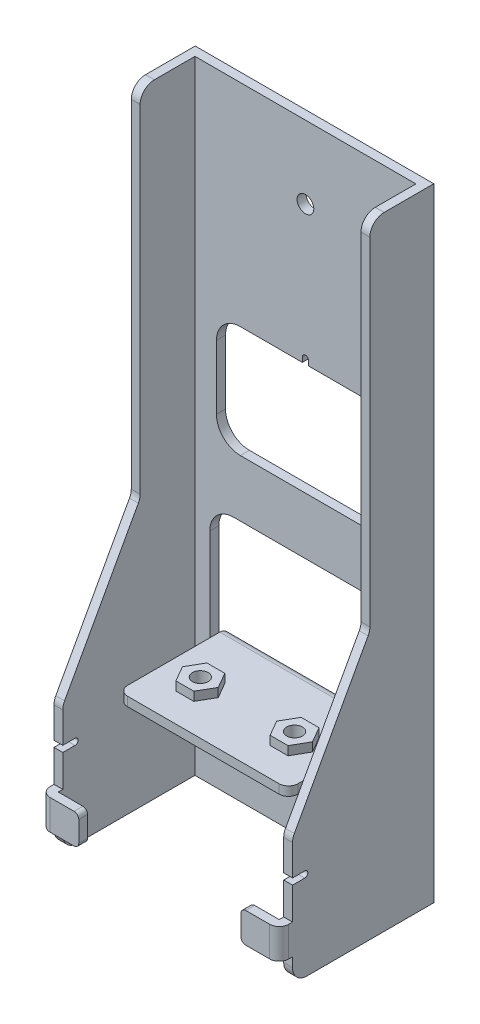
from build123d import *

# Parameters (mm, degrees)
ESQUISSE1_R           = 1.75
BOSS_EXTRU_1_DEPTH    = 1.9
ESQUISSE2_W           = 35.7
ESQUISSE2_H           = 1.9
BOSS_EXTRU_2_DEPTH    = 21.4
CONG_1_R              = 2
CONG_2_R              = 0.2
CONG_3_R              = 2
BOSS_EXTRU_3_DEPTH    = 1.85
TROU_TARAUD_M41_D     = 3.3
BOSS_EXTRU_4_DEPTH    = 1.85
CONG_4_R              = 3
ESQUISSE7_W           = 8
ESQUISSE7_H           = 6.3
BOSS_EXTRU_5_DEPTH    = 1.85
CONG_5_R              = 1
CONG_6_R              = 2
CONG_4_OF_SYM_TRIE1_R = 3
CONG_5_OF_SYM_TRIE1_R = 1
CONG_6_OF_SYM_TRIE1_R = 2


with BuildPart() as part:
    # Esquisse1 → Boss.-Extru.1 (new body)
    with BuildSketch(Plane.XY):
        with BuildLine():
            Line((25, 0), (2.5, 0))
            Line((2.5, 0), (2.5, 2.8))
            ThreePointArc((2.5, 2.8), (0, 5.3), (-2.5, 2.8))
            Line((-2.5, 2.8), (-2.5, 0))
            Line((-2.5, 0), (-25, 0))
            Line((-25, 0), (-25, 130.5))
            Line((-25, 130.5), (25, 130.5))
            Line((25, 130.5), (25, 0))
        make_face()
        with Locations(Location((-18.05, 18.95, 0), (0, 0, 180))):
            Circle(ESQUISSE1_R, mode=Mode.SUBTRACT)
        with Locations(Location((18.05, 18.95, 0), (0, 0, 180))):
            Circle(ESQUISSE1_R, mode=Mode.SUBTRACT)
        with Locations(Location((0, 115.25, 0), (0, 0, 180))):
            Circle(ESQUISSE1_R, mode=Mode.SUBTRACT)
        with BuildLine():
            Line((-17.85, 26), (-17.85, 28.7))
            Line((-17.85, 28.7), (17.85, 28.7))
            Line((17.85, 28.7), (17.85, 26))
            ThreePointArc((17.85, 26), (18.95, 24.9), (20.05, 26))
            Line((20.05, 26), (20.05, 45.9))
            ThreePointArc((20.05, 45.9), (18.585533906, 49.435533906), (15.05, 50.9))
            Line((15.05, 50.9), (-15.05, 50.9))
            ThreePointArc((-15.05, 50.9), (-18.585533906, 49.435533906), (-20.05, 45.9))
            Line((-20.05, 45.9), (-20.05, 26))
            ThreePointArc((-20.05, 26), (-18.95, 24.9), (-17.85, 26))
        make_face(mode=Mode.SUBTRACT)
        with BuildLine():
            Line((-13.65, 86.2), (-0.65, 86.2))
            Line((-0.65, 86.2), (-0.65, 87.2))
            ThreePointArc((-0.65, 87.2), (0, 87.85), (0.65, 87.2))
            Line((0.65, 87.2), (0.65, 86.2))
            Line((0.65, 86.2), (13.65, 86.2))
            ThreePointArc((13.65, 86.2), (17.185533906, 84.735533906), (18.65, 81.2))
            Line((18.65, 81.2), (18.65, 67.8))
            ThreePointArc((18.65, 67.8), (17.185533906, 64.264466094), (13.65, 62.8))
            Line((13.65, 62.8), (-13.65, 62.8))
            ThreePointArc((-13.65, 62.8), (-17.185533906, 64.264466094), (-18.65, 67.8))
            Line((-18.65, 67.8), (-18.65, 81.2))
            ThreePointArc((-18.65, 81.2), (-17.185533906, 84.735533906), (-13.65, 86.2))
        make_face(mode=Mode.SUBTRACT)
    extrude(amount=BOSS_EXTRU_1_DEPTH)

    # Esquisse2 → Boss.-Extru.2 (add)
    with BuildSketch(Plane.XY.offset(1.9)):
        with Locations((0, 27.75)):
            Rectangle(ESQUISSE2_W, ESQUISSE2_H)
    extrude(amount=BOSS_EXTRU_2_DEPTH)

    # Cong_1
    cong_1_edges = [part.edges().sort_by_distance(p)[0] for p in [
        (-17.85, 27.75, 23.3),
        (17.85, 27.75, 23.3),
    ]]
    fillet(cong_1_edges, radius=CONG_1_R)

    # Cong_2
    cong_2_edges = [part.edges().sort_by_distance(p)[0] for p in [
        (0, 26.8, 1.9),
    ]]
    fillet(cong_2_edges, radius=CONG_2_R)

    # Cong_3
    cong_3_edges = [part.edges().sort_by_distance(p)[0] for p in [
        (0, 28.7, 0),
    ]]
    fillet(cong_3_edges, radius=CONG_3_R)

    # Esquisse3 → Boss.-Extru.3 (add)
    with BuildSketch(Plane(origin=(0, 28.7, 0), x_dir=(1, 0, 0), z_dir=(0, 1, 0))):
        Polygon((6.12222325, -14.05), (7.998611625, -17.3), (11.751388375, -17.3), (13.62777675, -14.05), (11.751388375, -10.8), (7.998611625, -10.8), align=None)
        Polygon((-6.12222325, -14.05), (-7.998611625, -10.8), (-11.751388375, -10.8), (-13.62777675, -14.05), (-11.751388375, -17.3), (-7.998611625, -17.3), align=None)
    extrude(amount=BOSS_EXTRU_3_DEPTH)

    # Trou taraud_ M41 (through all)
    with Locations(Plane(origin=(0, 30.55, 0), x_dir=(-1, 0, 0), z_dir=(0, 1, 0))):
        with Locations((-9.875, 14.05), (9.875, 14.05)):
            Hole(TROU_TARAUD_M41_D / 2)

    # Esquisse6 → Boss.-Extru.4 (add)
    with BuildSketch(Plane.ZY.offset(25)):
        with BuildLine():
            Line((13.4, 130.5), (13.4, 56))
            Line((13.4, 56), (29.6, 26.5))
            Line((29.6, 26.5), (29.6, 19.3))
            Line((29.6, 19.3), (27.05, 19.3))
            ThreePointArc((27.05, 19.3), (26.4, 18.65), (27.05, 18))
            Line((27.05, 18), (29.6, 18))
            Line((29.6, 18), (29.6, 11.3))
            Line((29.6, 11.3), (32.4, 11.3))
            Line((32.4, 11.3), (32.4, 5))
            Line((32.4, 5), (29.6, 5))
            Line((29.6, 5), (29.6, 0))
            Line((29.6, 0), (0, 0))
            Line((0, 0), (0, 130.5))
            Line((0, 130.5), (13.4, 130.5))
        make_face()
    boss_extru_4 = extrude(amount=-BOSS_EXTRU_4_DEPTH)

    # Cong_4
    cong_4_edges = [part.edges().sort_by_distance(p)[0] for p in [
        (-24.075, 130.5, 13.4),
        (-24.075, 56, 13.4),
        (-24.075, 26.5, 29.6),
        (-24.075, 0, 29.6),
    ]]
    fillet(cong_4_edges, radius=CONG_4_R)

    # Esquisse7 → Boss.-Extru.5 (add)
    with BuildSketch(Plane.XY.offset(32.4)):
        with Locations((-21, 8.15)):
            Rectangle(ESQUISSE7_W, ESQUISSE7_H)
    boss_extru_5 = extrude(amount=-BOSS_EXTRU_5_DEPTH)

    # Cong_5
    cong_5_edges = [part.edges().sort_by_distance(p)[0] for p in [
        (-17, 5, 31.475),
        (-17, 11.3, 31.475),
    ]]
    fillet(cong_5_edges, radius=CONG_5_R)

    # Cong_6
    cong_6_edges = [part.edges().sort_by_distance(p)[0] for p in [
        (-25, 8.15, 32.4),
    ]]
    fillet(cong_6_edges, radius=CONG_6_R)

    # Sym_trie1: Boss.-Extru.4, Boss.-Extru.5 across plane
    add(boss_extru_4.mirror(Plane(origin=(0, 0, 0), x_dir=(0, 0, 1), z_dir=(1, 0, 0))))
    add(boss_extru_5.mirror(Plane(origin=(0, 0, 0), x_dir=(0, 0, 1), z_dir=(1, 0, 0))))

    # Cong_4 of Sym_trie1
    cong_4_of_sym_trie1_edges = [part.edges().sort_by_distance(p)[0] for p in [
        (24.075, 130.5, 13.4),
        (24.075, 56, 13.4),
        (24.075, 26.5, 29.6),
        (24.075, 0, 29.6),
    ]]
    fillet(cong_4_of_sym_trie1_edges, radius=CONG_4_OF_SYM_TRIE1_R)

    # Cong_5 of Sym_trie1
    cong_5_of_sym_trie1_edges = [part.edges().sort_by_distance(p)[0] for p in [
        (17, 5, 31.475),
        (17, 11.3, 31.475),
    ]]
    fillet(cong_5_of_sym_trie1_edges, radius=CONG_5_OF_SYM_TRIE1_R)

    # Cong_6 of Sym_trie1
    cong_6_of_sym_trie1_edges = [part.edges().sort_by_distance(p)[0] for p in [
        (25, 8.15, 32.4),
    ]]
    fillet(cong_6_of_sym_trie1_edges, radius=CONG_6_OF_SYM_TRIE1_R)


solid = part.part
